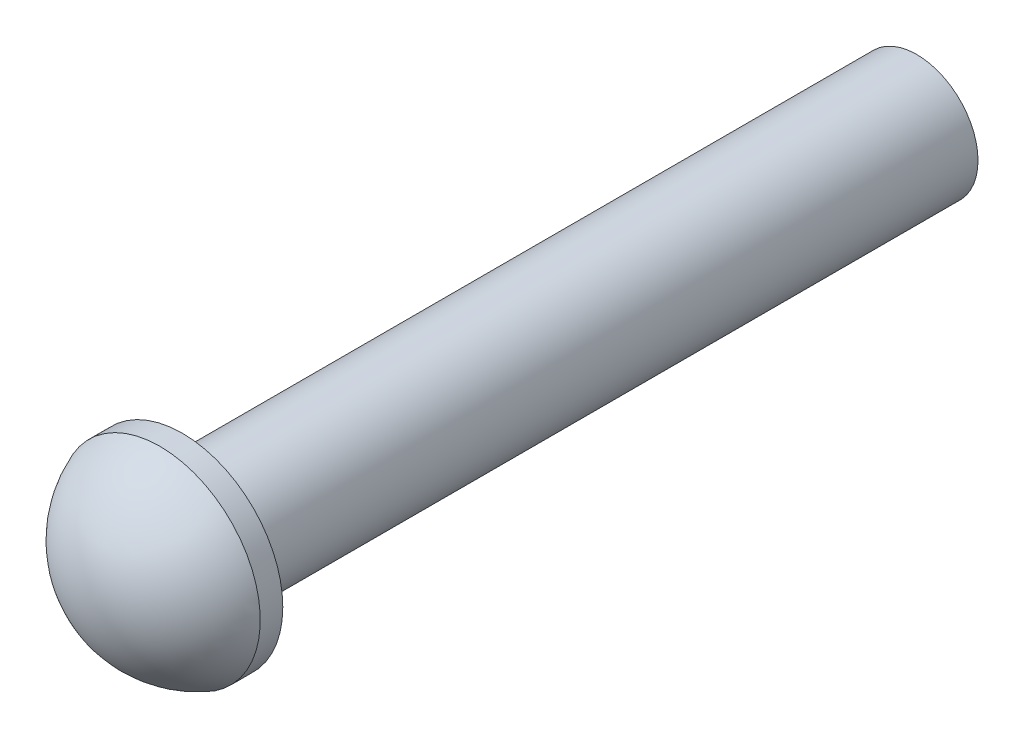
ISO-10303-21;
HEADER;
FILE_DESCRIPTION(('STEP AP214'),'2;1');
FILE_NAME('part.step','',(''),(''),'','','');
FILE_SCHEMA(('AUTOMOTIVE_DESIGN { 1 0 10303 214 1 1 1 1 }'));
ENDSEC;
DATA;
#1=APPLICATION_CONTEXT('core data for automotive mechanical design processes');
#2=APPLICATION_PROTOCOL_DEFINITION('international standard','automotive_design',2000,#1);
#3=PRODUCT_CONTEXT('',#1,'mechanical');
#4=PRODUCT('Part','Part','',(#3));
#5=PRODUCT_RELATED_PRODUCT_CATEGORY('part','',(#4));
#6=PRODUCT_DEFINITION_FORMATION('','',#4);
#7=PRODUCT_DEFINITION_CONTEXT('part definition',#1,'design');
#8=PRODUCT_DEFINITION('design','',#6,#7);
#9=PRODUCT_DEFINITION_SHAPE('','',#8);
#10=(LENGTH_UNIT() NAMED_UNIT(*) SI_UNIT(.MILLI.,.METRE.));
#11=(NAMED_UNIT(*) PLANE_ANGLE_UNIT() SI_UNIT($,.RADIAN.));
#12=(NAMED_UNIT(*) SI_UNIT($,.STERADIAN.) SOLID_ANGLE_UNIT());
#13=UNCERTAINTY_MEASURE_WITH_UNIT(LENGTH_MEASURE(1.E-05),#10,'distance_accuracy_value','');
#14=(GEOMETRIC_REPRESENTATION_CONTEXT(3) GLOBAL_UNCERTAINTY_ASSIGNED_CONTEXT((#13)) GLOBAL_UNIT_ASSIGNED_CONTEXT((#10,
#11,#12)) REPRESENTATION_CONTEXT('',''));
#15=CARTESIAN_POINT('',(0.,0.,0.));
#16=DIRECTION('',(0.,0.,1.));
#17=DIRECTION('',(1.,0.,0.));
#18=AXIS2_PLACEMENT_3D('',#15,#16,#17);
#19=CARTESIAN_POINT('',(0.,0.,-10.7188));
#20=DIRECTION('',(0.,0.,1.));
#21=DIRECTION('',(1.,0.,0.));
#22=AXIS2_PLACEMENT_3D('',#19,#20,#21);
#23=PLANE('',#22);
#24=CARTESIAN_POINT('',(0.,0.,-10.7188));
#25=DIRECTION('',(0.,0.,1.));
#26=DIRECTION('',(1.,0.,0.));
#27=AXIS2_PLACEMENT_3D('',#24,#25,#26);
#28=CIRCLE('',#27,1.5875);
#29=CARTESIAN_POINT('',(1.5875,0.,-10.7188));
#30=VERTEX_POINT('',#29);
#31=EDGE_CURVE('E11',#30,#30,#28,.T.);
#32=ORIENTED_EDGE('',*,*,#31,.F.);
#33=EDGE_LOOP('',(#32));
#34=FACE_BOUND('',#33,.T.);
#35=CARTESIAN_POINT('',(0.,0.,-10.7188));
#36=DIRECTION('',(0.,0.,1.));
#37=DIRECTION('',(1.,0.,0.));
#38=AXIS2_PLACEMENT_3D('',#35,#36,#37);
#39=CIRCLE('',#38,1.190625);
#40=CARTESIAN_POINT('',(1.190625,0.,-10.7188));
#41=VERTEX_POINT('',#40);
#42=EDGE_CURVE('E34',#41,#41,#39,.F.);
#43=ORIENTED_EDGE('',*,*,#42,.F.);
#44=EDGE_LOOP('',(#43));
#45=FACE_BOUND('',#44,.T.);
#46=ADVANCED_FACE('F31',(#34,#45),#23,.F.);
#47=CARTESIAN_POINT('',(0.,0.,13.3882590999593));
#48=DIRECTION('',(0.,0.,1.));
#49=DIRECTION('',(1.,0.,0.));
#50=AXIS2_PLACEMENT_3D('',#47,#48,#49);
#51=CYLINDRICAL_SURFACE('',#50,1.5875);
#52=CARTESIAN_POINT('',(0.,0.,8.3312));
#53=DIRECTION('',(0.,0.,1.));
#54=DIRECTION('',(1.,0.,0.));
#55=AXIS2_PLACEMENT_3D('',#52,#53,#54);
#56=CIRCLE('',#55,1.5875);
#57=CARTESIAN_POINT('',(1.5875,0.,8.3312));
#58=VERTEX_POINT('',#57);
#59=EDGE_CURVE('E38',#58,#58,#56,.T.);
#60=ORIENTED_EDGE('',*,*,#59,.F.);
#61=EDGE_LOOP('',(#60));
#62=FACE_BOUND('',#61,.T.);
#63=ORIENTED_EDGE('',*,*,#31,.T.);
#64=EDGE_LOOP('',(#63));
#65=FACE_BOUND('',#64,.T.);
#66=ADVANCED_FACE('F77',(#62,#65),#51,.T.);
#67=CARTESIAN_POINT('',(0.,1.5875,8.3312));
#68=DIRECTION('',(0.,0.,1.));
#69=DIRECTION('',(1.,0.,0.));
#70=AXIS2_PLACEMENT_3D('',#67,#68,#69);
#71=PLANE('',#70);
#72=CARTESIAN_POINT('',(0.,0.,8.3312));
#73=DIRECTION('',(0.,0.,1.));
#74=DIRECTION('',(1.,0.,0.));
#75=AXIS2_PLACEMENT_3D('',#72,#73,#74);
#76=CIRCLE('',#75,2.6035);
#77=CARTESIAN_POINT('',(2.6035,0.,8.3312));
#78=VERTEX_POINT('',#77);
#79=EDGE_CURVE('E59',#78,#78,#76,.F.);
#80=ORIENTED_EDGE('',*,*,#79,.T.);
#81=EDGE_LOOP('',(#80));
#82=FACE_BOUND('',#81,.T.);
#83=ORIENTED_EDGE('',*,*,#59,.T.);
#84=EDGE_LOOP('',(#83));
#85=FACE_BOUND('',#84,.T.);
#86=ADVANCED_FACE('F71',(#82,#85),#71,.F.);
#87=CARTESIAN_POINT('',(0.,0.,0.));
#88=DIRECTION('',(0.,0.,-1.));
#89=DIRECTION('',(0.,1.,0.));
#90=AXIS2_PLACEMENT_3D('',#87,#88,#89);
#91=CYLINDRICAL_SURFACE('',#90,2.6035);
#92=CARTESIAN_POINT('',(0.,0.,8.91597710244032));
#93=DIRECTION('',(0.,0.,-1.));
#94=DIRECTION('',(0.,1.,0.));
#95=AXIS2_PLACEMENT_3D('',#92,#93,#94);
#96=CIRCLE('',#95,2.6035);
#97=CARTESIAN_POINT('',(0.,2.6035,8.91597710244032));
#98=VERTEX_POINT('',#97);
#99=EDGE_CURVE('E55',#98,#98,#96,.F.);
#100=ORIENTED_EDGE('',*,*,#99,.F.);
#101=EDGE_LOOP('',(#100));
#102=FACE_BOUND('',#101,.T.);
#103=ORIENTED_EDGE('',*,*,#79,.F.);
#104=EDGE_LOOP('',(#103));
#105=FACE_BOUND('',#104,.T.);
#106=ADVANCED_FACE('F68',(#102,#105),#91,.T.);
#107=CARTESIAN_POINT('',(0.,0.,7.9375));
#108=DIRECTION('',(0.,0.,1.));
#109=DIRECTION('',(0.,1.,0.));
#110=AXIS2_PLACEMENT_3D('',#107,#108,#109);
#111=SPHERICAL_SURFACE('',#110,2.7813);
#112=ORIENTED_EDGE('',*,*,#99,.T.);
#113=EDGE_LOOP('',(#112));
#114=FACE_BOUND('',#113,.T.);
#115=ADVANCED_FACE('F66',(#114),#111,.T.);
#116=CARTESIAN_POINT('',(0.,0.,-11.4062076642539));
#117=DIRECTION('',(0.,0.,-1.));
#118=DIRECTION('',(-1.,0.,0.));
#119=AXIS2_PLACEMENT_3D('',#116,#117,#118);
#120=CONICAL_SURFACE('',#119,1.5875,0.523598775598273);
#121=CARTESIAN_POINT('',(0.,0.,-9.68603872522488));
#122=DIRECTION('',(0.,0.,1.));
#123=DIRECTION('',(1.,0.,0.));
#124=AXIS2_PLACEMENT_3D('',#121,#122,#123);
#125=CIRCLE('',#124,0.59436);
#126=CARTESIAN_POINT('',(0.59436,0.,-9.68603872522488));
#127=VERTEX_POINT('',#126);
#128=EDGE_CURVE('E52',#127,#127,#125,.T.);
#129=ORIENTED_EDGE('',*,*,#128,.T.);
#130=EDGE_LOOP('',(#129));
#131=FACE_BOUND('',#130,.T.);
#132=ORIENTED_EDGE('',*,*,#42,.T.);
#133=EDGE_LOOP('',(#132));
#134=FACE_BOUND('',#133,.T.);
#135=ADVANCED_FACE('F46',(#131,#134),#120,.F.);
#136=CARTESIAN_POINT('',(0.,0.,-8.49541372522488));
#137=DIRECTION('',(0.,0.,-1.));
#138=DIRECTION('',(-1.,0.,0.));
#139=AXIS2_PLACEMENT_3D('',#136,#137,#138);
#140=CONICAL_SURFACE('',#139,0.59436,0.785398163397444);
#141=CARTESIAN_POINT('',(0.,0.,-7.90105372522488));
#142=VERTEX_POINT('',#141);
#143=VERTEX_LOOP('',#142);
#144=FACE_BOUND('',#143,.T.);
#145=CARTESIAN_POINT('',(0.,0.,-8.49541372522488));
#146=DIRECTION('',(0.,0.,1.));
#147=DIRECTION('',(1.,0.,0.));
#148=AXIS2_PLACEMENT_3D('',#145,#146,#147);
#149=CIRCLE('',#148,0.59436);
#150=CARTESIAN_POINT('',(0.59436,0.,-8.49541372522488));
#151=VERTEX_POINT('',#150);
#152=EDGE_CURVE('E50',#151,#151,#149,.T.);
#153=ORIENTED_EDGE('',*,*,#152,.F.);
#154=EDGE_LOOP('',(#153));
#155=FACE_BOUND('',#154,.T.);
#156=ADVANCED_FACE('F42',(#144,#155),#140,.F.);
#157=CARTESIAN_POINT('',(0.,0.,0.));
#158=DIRECTION('',(0.,0.,1.));
#159=DIRECTION('',(1.,0.,0.));
#160=AXIS2_PLACEMENT_3D('',#157,#158,#159);
#161=CYLINDRICAL_SURFACE('',#160,0.59436);
#162=ORIENTED_EDGE('',*,*,#152,.T.);
#163=EDGE_LOOP('',(#162));
#164=FACE_BOUND('',#163,.T.);
#165=ORIENTED_EDGE('',*,*,#128,.F.);
#166=EDGE_LOOP('',(#165));
#167=FACE_BOUND('',#166,.T.);
#168=ADVANCED_FACE('F45',(#164,#167),#161,.F.);
#169=CLOSED_SHELL('',(#46,#66,#86,#106,#115,#135,#156,#168));
#170=MANIFOLD_SOLID_BREP('B2',#169);
#171=ADVANCED_BREP_SHAPE_REPRESENTATION('',(#18,#170),#14);
#172=SHAPE_DEFINITION_REPRESENTATION(#9,#171);
ENDSEC;
END-ISO-10303-21;
